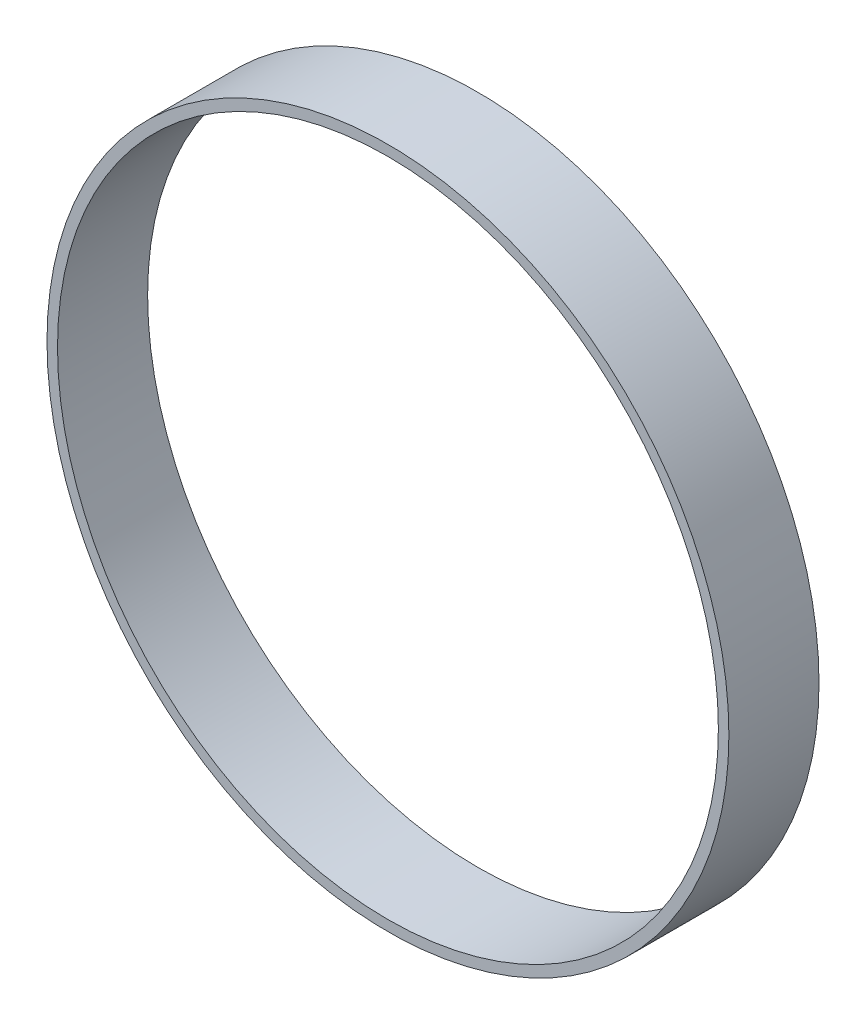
ISO-10303-21;
HEADER;
FILE_DESCRIPTION(('STEP AP214'),'2;1');
FILE_NAME('part.step','',(''),(''),'','','');
FILE_SCHEMA(('AUTOMOTIVE_DESIGN { 1 0 10303 214 1 1 1 1 }'));
ENDSEC;
DATA;
#1=APPLICATION_CONTEXT('core data for automotive mechanical design processes');
#2=APPLICATION_PROTOCOL_DEFINITION('international standard','automotive_design',2000,#1);
#3=PRODUCT_CONTEXT('',#1,'mechanical');
#4=PRODUCT('Part','Part','',(#3));
#5=PRODUCT_RELATED_PRODUCT_CATEGORY('part','',(#4));
#6=PRODUCT_DEFINITION_FORMATION('','',#4);
#7=PRODUCT_DEFINITION_CONTEXT('part definition',#1,'design');
#8=PRODUCT_DEFINITION('design','',#6,#7);
#9=PRODUCT_DEFINITION_SHAPE('','',#8);
#10=(LENGTH_UNIT() NAMED_UNIT(*) SI_UNIT(.MILLI.,.METRE.));
#11=(NAMED_UNIT(*) PLANE_ANGLE_UNIT() SI_UNIT($,.RADIAN.));
#12=(NAMED_UNIT(*) SI_UNIT($,.STERADIAN.) SOLID_ANGLE_UNIT());
#13=UNCERTAINTY_MEASURE_WITH_UNIT(LENGTH_MEASURE(1.E-05),#10,'distance_accuracy_value','');
#14=(GEOMETRIC_REPRESENTATION_CONTEXT(3) GLOBAL_UNCERTAINTY_ASSIGNED_CONTEXT((#13)) GLOBAL_UNIT_ASSIGNED_CONTEXT((#10,
#11,#12)) REPRESENTATION_CONTEXT('',''));
#15=CARTESIAN_POINT('',(0.,0.,0.));
#16=DIRECTION('',(0.,0.,1.));
#17=DIRECTION('',(1.,0.,0.));
#18=AXIS2_PLACEMENT_3D('',#15,#16,#17);
#19=CARTESIAN_POINT('',(0.,0.,6.));
#20=DIRECTION('',(0.,0.,1.));
#21=DIRECTION('',(1.,0.,0.));
#22=AXIS2_PLACEMENT_3D('',#19,#20,#21);
#23=PLANE('',#22);
#24=CARTESIAN_POINT('',(0.,0.,6.));
#25=DIRECTION('',(0.,0.,1.));
#26=DIRECTION('',(1.,0.,0.));
#27=AXIS2_PLACEMENT_3D('',#24,#25,#26);
#28=CIRCLE('',#27,22.7);
#29=CARTESIAN_POINT('',(22.7,0.,6.));
#30=VERTEX_POINT('',#29);
#31=EDGE_CURVE('E10',#30,#30,#28,.T.);
#32=ORIENTED_EDGE('',*,*,#31,.T.);
#33=EDGE_LOOP('',(#32));
#34=FACE_BOUND('',#33,.T.);
#35=CARTESIAN_POINT('',(0.,0.,6.));
#36=DIRECTION('',(0.,0.,1.));
#37=DIRECTION('',(1.,0.,0.));
#38=AXIS2_PLACEMENT_3D('',#35,#36,#37);
#39=CIRCLE('',#38,22.);
#40=CARTESIAN_POINT('',(22.,0.,6.));
#41=VERTEX_POINT('',#40);
#42=EDGE_CURVE('E40',#41,#41,#39,.T.);
#43=ORIENTED_EDGE('',*,*,#42,.F.);
#44=EDGE_LOOP('',(#43));
#45=FACE_BOUND('',#44,.T.);
#46=ADVANCED_FACE('F29',(#34,#45),#23,.T.);
#47=CARTESIAN_POINT('',(0.,0.,0.));
#48=DIRECTION('',(0.,0.,1.));
#49=DIRECTION('',(1.,0.,0.));
#50=AXIS2_PLACEMENT_3D('',#47,#48,#49);
#51=PLANE('',#50);
#52=CARTESIAN_POINT('',(0.,0.,0.));
#53=DIRECTION('',(0.,0.,1.));
#54=DIRECTION('',(1.,0.,0.));
#55=AXIS2_PLACEMENT_3D('',#52,#53,#54);
#56=CIRCLE('',#55,22.7);
#57=CARTESIAN_POINT('',(22.7,0.,0.));
#58=VERTEX_POINT('',#57);
#59=EDGE_CURVE('E36',#58,#58,#56,.T.);
#60=ORIENTED_EDGE('',*,*,#59,.F.);
#61=EDGE_LOOP('',(#60));
#62=FACE_BOUND('',#61,.T.);
#63=CARTESIAN_POINT('',(0.,0.,0.));
#64=DIRECTION('',(0.,0.,1.));
#65=DIRECTION('',(1.,0.,0.));
#66=AXIS2_PLACEMENT_3D('',#63,#64,#65);
#67=CIRCLE('',#66,22.);
#68=CARTESIAN_POINT('',(22.,0.,0.));
#69=VERTEX_POINT('',#68);
#70=EDGE_CURVE('E44',#69,#69,#67,.T.);
#71=ORIENTED_EDGE('',*,*,#70,.T.);
#72=EDGE_LOOP('',(#71));
#73=FACE_BOUND('',#72,.T.);
#74=ADVANCED_FACE('F50',(#62,#73),#51,.F.);
#75=CARTESIAN_POINT('',(0.,0.,6.));
#76=DIRECTION('',(0.,0.,-1.));
#77=DIRECTION('',(-1.,0.,0.));
#78=AXIS2_PLACEMENT_3D('',#75,#76,#77);
#79=CYLINDRICAL_SURFACE('',#78,22.7);
#80=ORIENTED_EDGE('',*,*,#31,.F.);
#81=EDGE_LOOP('',(#80));
#82=FACE_BOUND('',#81,.T.);
#83=ORIENTED_EDGE('',*,*,#59,.T.);
#84=EDGE_LOOP('',(#83));
#85=FACE_BOUND('',#84,.T.);
#86=ADVANCED_FACE('F31',(#82,#85),#79,.T.);
#87=CARTESIAN_POINT('',(0.,0.,6.));
#88=DIRECTION('',(0.,0.,-1.));
#89=DIRECTION('',(-1.,0.,0.));
#90=AXIS2_PLACEMENT_3D('',#87,#88,#89);
#91=CYLINDRICAL_SURFACE('',#90,22.);
#92=ORIENTED_EDGE('',*,*,#42,.T.);
#93=EDGE_LOOP('',(#92));
#94=FACE_BOUND('',#93,.T.);
#95=ORIENTED_EDGE('',*,*,#70,.F.);
#96=EDGE_LOOP('',(#95));
#97=FACE_BOUND('',#96,.T.);
#98=ADVANCED_FACE('F52',(#94,#97),#91,.F.);
#99=CLOSED_SHELL('',(#46,#74,#86,#98));
#100=MANIFOLD_SOLID_BREP('B2',#99);
#101=ADVANCED_BREP_SHAPE_REPRESENTATION('',(#18,#100),#14);
#102=SHAPE_DEFINITION_REPRESENTATION(#9,#101);
ENDSEC;
END-ISO-10303-21;
